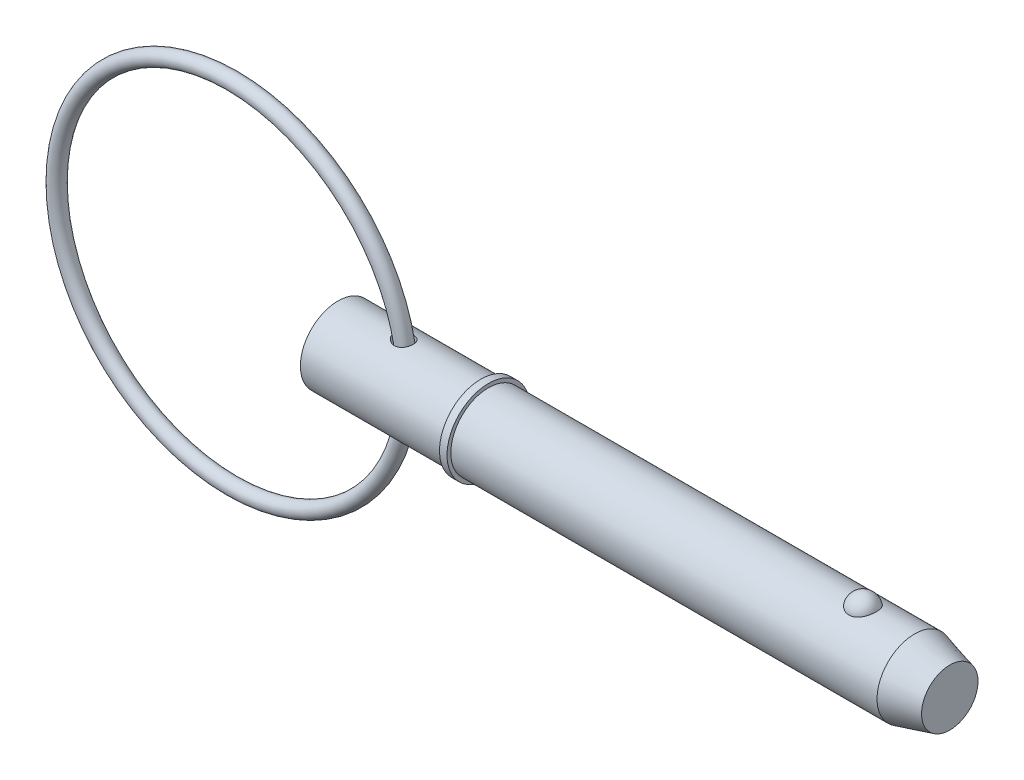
ISO-10303-21;
HEADER;
FILE_DESCRIPTION(('STEP AP214'),'2;1');
FILE_NAME('part.step','',(''),(''),'','','');
FILE_SCHEMA(('AUTOMOTIVE_DESIGN { 1 0 10303 214 1 1 1 1 }'));
ENDSEC;
DATA;
#1=APPLICATION_CONTEXT('core data for automotive mechanical design processes');
#2=APPLICATION_PROTOCOL_DEFINITION('international standard','automotive_design',2000,#1);
#3=PRODUCT_CONTEXT('',#1,'mechanical');
#4=PRODUCT('Part','Part','',(#3));
#5=PRODUCT_RELATED_PRODUCT_CATEGORY('part','',(#4));
#6=PRODUCT_DEFINITION_FORMATION('','',#4);
#7=PRODUCT_DEFINITION_CONTEXT('part definition',#1,'design');
#8=PRODUCT_DEFINITION('design','',#6,#7);
#9=PRODUCT_DEFINITION_SHAPE('','',#8);
#10=(LENGTH_UNIT() NAMED_UNIT(*) SI_UNIT(.MILLI.,.METRE.));
#11=(NAMED_UNIT(*) PLANE_ANGLE_UNIT() SI_UNIT($,.RADIAN.));
#12=(NAMED_UNIT(*) SI_UNIT($,.STERADIAN.) SOLID_ANGLE_UNIT());
#13=UNCERTAINTY_MEASURE_WITH_UNIT(LENGTH_MEASURE(1.E-05),#10,'distance_accuracy_value','');
#14=(GEOMETRIC_REPRESENTATION_CONTEXT(3) GLOBAL_UNCERTAINTY_ASSIGNED_CONTEXT((#13)) GLOBAL_UNIT_ASSIGNED_CONTEXT((#10,
#11,#12)) REPRESENTATION_CONTEXT('',''));
#15=CARTESIAN_POINT('',(0.,0.,0.));
#16=DIRECTION('',(0.,0.,1.));
#17=DIRECTION('',(1.,0.,0.));
#18=AXIS2_PLACEMENT_3D('',#15,#16,#17);
#19=CARTESIAN_POINT('',(-13.4013067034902,0.,0.));
#20=DIRECTION('',(0.,0.,1.));
#21=DIRECTION('',(1.,0.,0.));
#22=AXIS2_PLACEMENT_3D('',#19,#20,#21);
#23=TOROIDAL_SURFACE('',#22,22.225,0.952999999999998);
#24=CARTESIAN_POINT('',(9.77669329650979,0.,0.));
#25=VERTEX_POINT('',#24);
#26=VERTEX_LOOP('',#25);
#27=FACE_BOUND('',#26,.T.);
#28=ADVANCED_FACE('P0_F12',(#27),#23,.T.);
#29=CLOSED_SHELL('',(#28));
#30=MANIFOLD_SOLID_BREP('P0_B1',#29);
#31=CARTESIAN_POINT('',(0.,0.,0.));
#32=DIRECTION('',(1.,0.,0.));
#33=DIRECTION('',(0.,0.,-1.));
#34=AXIS2_PLACEMENT_3D('',#31,#32,#33);
#35=CYLINDRICAL_SURFACE('',#34,4.765);
#36=CARTESIAN_POINT('',(7.31773584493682,4.71580709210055,-0.682926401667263));
#37=CARTESIAN_POINT('',(7.3607471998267,4.70750812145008,-0.740230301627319));
#38=CARTESIAN_POINT('',(7.40883112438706,4.69869300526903,-0.79371122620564));
#39=CARTESIAN_POINT('',(7.51340999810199,4.68106981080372,-0.89180043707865));
#40=CARTESIAN_POINT('',(7.56991882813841,4.67226176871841,-0.936393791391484));
#41=CARTESIAN_POINT('',(7.689548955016,4.65568581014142,-1.01560363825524));
#42=CARTESIAN_POINT('',(7.75265928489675,4.64791621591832,-1.05023633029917));
#43=CARTESIAN_POINT('',(7.88387110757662,4.6343185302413,-1.10870278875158));
#44=CARTESIAN_POINT('',(7.95197058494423,4.62848966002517,-1.13254088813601));
#45=CARTESIAN_POINT('',(8.09209413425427,4.6194749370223,-1.16877415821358));
#46=CARTESIAN_POINT('',(8.16415141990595,4.6163169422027,-1.18104886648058));
#47=CARTESIAN_POINT('',(8.30937958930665,4.61324608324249,-1.19299123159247));
#48=CARTESIAN_POINT('',(8.38255011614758,4.61333220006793,-1.19266284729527));
#49=CARTESIAN_POINT('',(8.52374186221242,4.61674026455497,-1.17939593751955));
#50=CARTESIAN_POINT('',(8.59183022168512,4.61989017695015,-1.16712781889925));
#51=CARTESIAN_POINT('',(8.72470143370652,4.62884731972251,-1.13107903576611));
#52=CARTESIAN_POINT('',(8.78948513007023,4.63465386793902,-1.10730132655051));
#53=CARTESIAN_POINT('',(8.91088768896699,4.64792402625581,-1.05016249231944));
#54=CARTESIAN_POINT('',(8.96774302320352,4.65530108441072,-1.01728198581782));
#55=CARTESIAN_POINT('',(9.07499804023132,4.67102002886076,-0.942471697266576));
#56=CARTESIAN_POINT('',(9.12539777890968,4.6793619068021,-0.900541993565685));
#57=CARTESIAN_POINT('',(9.21836221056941,4.69607497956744,-0.808868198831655));
#58=CARTESIAN_POINT('',(9.26093651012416,4.70444612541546,-0.759133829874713));
#59=CARTESIAN_POINT('',(9.33728390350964,4.72032100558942,-0.653192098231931));
#60=CARTESIAN_POINT('',(9.3710564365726,4.72782468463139,-0.596984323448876));
#61=CARTESIAN_POINT('',(9.42940600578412,4.74126034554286,-0.478808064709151));
#62=CARTESIAN_POINT('',(9.45384681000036,4.74716869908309,-0.416769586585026));
#63=CARTESIAN_POINT('',(9.49226260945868,4.75663465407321,-0.289362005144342));
#64=CARTESIAN_POINT('',(9.50623742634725,4.76019221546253,-0.22399284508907));
#65=CARTESIAN_POINT('',(9.52342004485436,4.76458450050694,-0.0914886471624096));
#66=CARTESIAN_POINT('',(9.52658321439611,4.7654079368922,-0.0243474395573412));
#67=CARTESIAN_POINT('',(9.52194012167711,4.76421136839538,0.109528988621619));
#68=CARTESIAN_POINT('',(9.51413380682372,4.7621913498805,0.176264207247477));
#69=CARTESIAN_POINT('',(9.48775485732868,4.75552896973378,0.307367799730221));
#70=CARTESIAN_POINT('',(9.4691926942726,4.75088915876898,0.371738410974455));
#71=CARTESIAN_POINT('',(9.42175836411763,4.73949008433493,0.496364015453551));
#72=CARTESIAN_POINT('',(9.39288586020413,4.73273075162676,0.556618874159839));
#73=CARTESIAN_POINT('',(9.32549385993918,4.71782154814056,0.671371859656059));
#74=CARTESIAN_POINT('',(9.28696367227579,4.70967013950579,0.725863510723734));
#75=CARTESIAN_POINT('',(9.20123305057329,4.6928883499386,0.827453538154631));
#76=CARTESIAN_POINT('',(9.15403300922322,4.68425799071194,0.874552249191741));
#77=CARTESIAN_POINT('',(9.05250467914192,4.66754854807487,0.959736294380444));
#78=CARTESIAN_POINT('',(8.99822095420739,4.65946646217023,0.997874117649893));
#79=CARTESIAN_POINT('',(8.88381123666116,4.64472049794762,1.06440739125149));
#80=CARTESIAN_POINT('',(8.82368614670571,4.63805640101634,1.09280434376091));
#81=CARTESIAN_POINT('',(8.70022952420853,4.62698068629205,1.13878427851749));
#82=CARTESIAN_POINT('',(8.63695594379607,4.62253830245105,1.15651569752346));
#83=CARTESIAN_POINT('',(8.50825296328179,4.61622454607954,1.18146656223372));
#84=CARTESIAN_POINT('',(8.44282353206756,4.61435321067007,1.18868585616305));
#85=CARTESIAN_POINT('',(8.31119087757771,4.61332122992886,1.19268442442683));
#86=CARTESIAN_POINT('',(8.24498542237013,4.61417920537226,1.18939198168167));
#87=CARTESIAN_POINT('',(8.11397487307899,4.61847671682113,1.17259121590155));
#88=CARTESIAN_POINT('',(8.04917011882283,4.62191687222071,1.15908044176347));
#89=CARTESIAN_POINT('',(7.91946226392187,4.63117528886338,1.12153047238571));
#90=CARTESIAN_POINT('',(7.85470460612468,4.6371000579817,1.09701575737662));
#91=CARTESIAN_POINT('',(7.7300035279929,4.65063246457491,1.03814807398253));
#92=CARTESIAN_POINT('',(7.67006197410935,4.65824075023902,1.00379131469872));
#93=CARTESIAN_POINT('',(7.55352765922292,4.67473656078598,0.924015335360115));
#94=CARTESIAN_POINT('',(7.49726947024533,4.68366994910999,0.878115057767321));
#95=CARTESIAN_POINT('',(7.39344083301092,4.70144936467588,0.777311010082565));
#96=CARTESIAN_POINT('',(7.34587087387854,4.71029538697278,0.722406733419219));
#97=CARTESIAN_POINT('',(7.26188955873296,4.72669773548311,0.605773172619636));
#98=CARTESIAN_POINT('',(7.22531316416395,4.73427229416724,0.544165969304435));
#99=CARTESIAN_POINT('',(7.16406269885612,4.74732663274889,0.415095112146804));
#100=CARTESIAN_POINT('',(7.13937848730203,4.75280819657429,0.347636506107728));
#101=CARTESIAN_POINT('',(7.10494917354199,4.7605495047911,0.215359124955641));
#102=CARTESIAN_POINT('',(7.09405441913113,4.76305589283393,0.150853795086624));
#103=CARTESIAN_POINT('',(7.08387189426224,4.76539656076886,0.0208839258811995));
#104=CARTESIAN_POINT('',(7.0845805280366,4.76523166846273,-0.0445803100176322));
#105=CARTESIAN_POINT('',(7.09709111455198,4.76236014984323,-0.169693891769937));
#106=CARTESIAN_POINT('',(7.10810913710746,4.75983315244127,-0.229428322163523));
#107=CARTESIAN_POINT('',(7.13959099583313,4.75276726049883,-0.346187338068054));
#108=CARTESIAN_POINT('',(7.16004881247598,4.7482296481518,-0.403213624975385));
#109=CARTESIAN_POINT('',(7.20270325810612,4.73907067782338,-0.498040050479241));
#110=CARTESIAN_POINT('',(7.22286864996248,4.73481668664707,-0.536809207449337));
#111=CARTESIAN_POINT('',(7.26730952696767,4.72570777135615,-0.611832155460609));
#112=CARTESIAN_POINT('',(7.29158512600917,4.72085283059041,-0.64808587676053));
#113=CARTESIAN_POINT('',(7.31773584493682,4.71580709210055,-0.682926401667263));
#114=B_SPLINE_CURVE_WITH_KNOTS('',3,(#36,#37,#38,#39,#40,#41,#42,#43,#44,#45,#46,#47,#48,#49,
#50,#51,#52,#53,#54,#55,#56,#57,#58,#59,#60,#61,#62,#63,#64,#65,#66,#67,#68,#69,#70,#71,#72,#73,
#74,#75,#76,#77,#78,#79,#80,#81,#82,#83,#84,#85,#86,#87,#88,#89,#90,#91,#92,#93,#94,#95,#96,#97,
#98,#99,#100,#101,#102,#103,#104,#105,#106,#107,#108,#109,#110,#111,#112,#113),.UNSPECIFIED.,
.T.,.F.,(4,2,2,2,2,2,2,2,2,2,2,2,2,2,2,2,2,2,2,2,2,2,2,2,2,2,2,2,2,2,2,2,2,2,2,2,2,2,4),(0.,
0.216219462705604,0.432799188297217,0.649024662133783,0.865163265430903,1.08352938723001,
1.30182691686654,1.50853487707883,1.71518978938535,1.91252381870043,2.1098561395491,
2.30694457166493,2.50404555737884,2.70392296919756,2.90380378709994,3.10450875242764,
3.30521468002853,3.5057255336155,3.70624293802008,3.90698330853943,4.10771458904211,
4.30723900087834,4.50673262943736,4.70338139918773,4.90003300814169,5.09802914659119,
5.29607279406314,5.5036500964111,5.7113074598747,5.92972727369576,6.14815938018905,
6.36312650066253,6.57790998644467,6.77325899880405,6.96854747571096,7.15009726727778,
7.33153144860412,7.46298830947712,7.59444881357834),.UNSPECIFIED.);
#115=CARTESIAN_POINT('',(7.31773584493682,4.71580709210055,-0.682926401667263));
#116=VERTEX_POINT('',#115);
#117=EDGE_CURVE('P1_E42',#116,#116,#114,.T.);
#118=ORIENTED_EDGE('',*,*,#117,.T.);
#119=EDGE_LOOP('',(#118));
#120=FACE_BOUND('',#119,.T.);
#121=CARTESIAN_POINT('',(0.,0.,0.));
#122=DIRECTION('',(1.,0.,0.));
#123=DIRECTION('',(0.,0.,-1.));
#124=AXIS2_PLACEMENT_3D('',#121,#122,#123);
#125=CIRCLE('',#124,4.765);
#126=CARTESIAN_POINT('',(0.,0.,-4.765));
#127=VERTEX_POINT('',#126);
#128=EDGE_CURVE('P1_E9',#127,#127,#125,.T.);
#129=ORIENTED_EDGE('',*,*,#128,.T.);
#130=EDGE_LOOP('',(#129));
#131=FACE_BOUND('',#130,.T.);
#132=CARTESIAN_POINT('',(18.097,0.,0.));
#133=DIRECTION('',(1.,0.,0.));
#134=DIRECTION('',(0.,0.,-1.));
#135=AXIS2_PLACEMENT_3D('',#132,#133,#134);
#136=CIRCLE('',#135,4.765);
#137=CARTESIAN_POINT('',(18.097,0.,-4.765));
#138=VERTEX_POINT('',#137);
#139=EDGE_CURVE('P1_E25',#138,#138,#136,.T.);
#140=ORIENTED_EDGE('',*,*,#139,.F.);
#141=EDGE_LOOP('',(#140));
#142=FACE_BOUND('',#141,.T.);
#143=CARTESIAN_POINT('',(7.31773584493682,-4.71580709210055,-0.682926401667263));
#144=CARTESIAN_POINT('',(7.27956054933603,-4.72317282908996,-0.63206220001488));
#145=CARTESIAN_POINT('',(7.24535712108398,-4.7301361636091,-0.578155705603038));
#146=CARTESIAN_POINT('',(7.18611785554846,-4.74256090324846,-0.465352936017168));
#147=CARTESIAN_POINT('',(7.16107836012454,-4.74802290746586,-0.406458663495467));
#148=CARTESIAN_POINT('',(7.12119149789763,-4.75686558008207,-0.284913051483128));
#149=CARTESIAN_POINT('',(7.1063796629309,-4.76023898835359,-0.222249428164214));
#150=CARTESIAN_POINT('',(7.08786546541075,-4.76447177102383,-0.0952170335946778));
#151=CARTESIAN_POINT('',(7.08416018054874,-4.76533180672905,-0.0308487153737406));
#152=CARTESIAN_POINT('',(7.08795686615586,-4.76445764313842,0.0942755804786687));
#153=CARTESIAN_POINT('',(7.09490366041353,-4.762851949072,0.155050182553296));
#154=CARTESIAN_POINT('',(7.11863973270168,-4.75746086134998,0.2745356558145));
#155=CARTESIAN_POINT('',(7.13542953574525,-4.75367535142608,0.333246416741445));
#156=CARTESIAN_POINT('',(7.17817193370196,-4.74430545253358,0.447305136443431));
#157=CARTESIAN_POINT('',(7.20415836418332,-4.73871442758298,0.502639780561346));
#158=CARTESIAN_POINT('',(7.26428068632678,-4.72628508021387,0.608523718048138));
#159=CARTESIAN_POINT('',(7.29841897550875,-4.71944639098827,0.659071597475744));
#160=CARTESIAN_POINT('',(7.37680984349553,-4.70456239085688,0.758311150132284));
#161=CARTESIAN_POINT('',(7.42165519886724,-4.69646426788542,0.806526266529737));
#162=CARTESIAN_POINT('',(7.51828933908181,-4.68032890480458,0.895428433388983));
#163=CARTESIAN_POINT('',(7.57008134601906,-4.67229169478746,0.936111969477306));
#164=CARTESIAN_POINT('',(7.68397204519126,-4.65640659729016,1.01229731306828));
#165=CARTESIAN_POINT('',(7.74657226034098,-4.64863251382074,1.04706751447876));
#166=CARTESIAN_POINT('',(7.87680110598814,-4.6349740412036,1.10596507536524));
#167=CARTESIAN_POINT('',(7.94443054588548,-4.62908995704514,1.13009071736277));
#168=CARTESIAN_POINT('',(8.08402017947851,-4.61989019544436,1.16713943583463));
#169=CARTESIAN_POINT('',(8.15603143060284,-4.61661596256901,1.17988211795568));
#170=CARTESIAN_POINT('',(8.30124697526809,-4.61330446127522,1.1927680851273));
#171=CARTESIAN_POINT('',(8.37445077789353,-4.61326589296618,1.19291642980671));
#172=CARTESIAN_POINT('',(8.51584800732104,-4.61644036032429,1.18056687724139));
#173=CARTESIAN_POINT('',(8.58410302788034,-4.61948317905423,1.16873099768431));
#174=CARTESIAN_POINT('',(8.71738052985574,-4.6282520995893,1.13350536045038));
#175=CARTESIAN_POINT('',(8.78240382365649,-4.63397752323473,1.11011852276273));
#176=CARTESIAN_POINT('',(8.90428519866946,-4.64711877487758,1.05371003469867));
#177=CARTESIAN_POINT('',(8.96138096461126,-4.6544450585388,1.02117932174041));
#178=CARTESIAN_POINT('',(9.06916653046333,-4.6700970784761,0.947021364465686));
#179=CARTESIAN_POINT('',(9.11985639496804,-4.67842280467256,0.905394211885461));
#180=CARTESIAN_POINT('',(9.2134071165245,-4.69513303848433,0.814300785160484));
#181=CARTESIAN_POINT('',(9.25628268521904,-4.70351740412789,0.764849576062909));
#182=CARTESIAN_POINT('',(9.33327173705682,-4.71945185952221,0.659422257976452));
#183=CARTESIAN_POINT('',(9.3673846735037,-4.72700189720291,0.603445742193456));
#184=CARTESIAN_POINT('',(9.42645214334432,-4.74055953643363,0.485673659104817));
#185=CARTESIAN_POINT('',(9.45127042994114,-4.74654383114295,0.423807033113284));
#186=CARTESIAN_POINT('',(9.49046298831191,-4.756182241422,0.296676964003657));
#187=CARTESIAN_POINT('',(9.50483706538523,-4.75983631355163,0.231413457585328));
#188=CARTESIAN_POINT('',(9.52283408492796,-4.76443282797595,0.0990368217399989));
#189=CARTESIAN_POINT('',(9.52641016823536,-4.76536345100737,0.0319169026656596));
#190=CARTESIAN_POINT('',(9.52259067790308,-4.76437893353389,-0.101988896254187));
#191=CARTESIAN_POINT('',(9.5151950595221,-4.76246378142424,-0.168774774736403));
#192=CARTESIAN_POINT('',(9.48962516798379,-4.75599746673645,-0.300048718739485));
#193=CARTESIAN_POINT('',(9.4714615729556,-4.75144891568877,-0.364538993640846));
#194=CARTESIAN_POINT('',(9.42480303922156,-4.74020887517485,-0.489470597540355));
#195=CARTESIAN_POINT('',(9.396307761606,-4.73351731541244,-0.549911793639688));
#196=CARTESIAN_POINT('',(9.32963953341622,-4.71871240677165,-0.665099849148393));
#197=CARTESIAN_POINT('',(9.29145577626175,-4.71059747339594,-0.719840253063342));
#198=CARTESIAN_POINT('',(9.20637695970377,-4.69385254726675,-0.82198328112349));
#199=CARTESIAN_POINT('',(9.15948227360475,-4.68522257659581,-0.869386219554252));
#200=CARTESIAN_POINT('',(9.05849937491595,-4.66847516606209,-0.955233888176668));
#201=CARTESIAN_POINT('',(9.00445430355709,-4.6603550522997,-0.993728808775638));
#202=CARTESIAN_POINT('',(8.8904576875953,-4.64550122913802,-1.06100691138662));
#203=CARTESIAN_POINT('',(8.83050704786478,-4.63876730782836,-1.08979157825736));
#204=CARTESIAN_POINT('',(8.70732873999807,-4.6275305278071,-1.13655620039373));
#205=CARTESIAN_POINT('',(8.64416019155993,-4.62299714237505,-1.15468477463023));
#206=CARTESIAN_POINT('',(8.51559711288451,-4.61649071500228,-1.18043067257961));
#207=CARTESIAN_POINT('',(8.4502025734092,-4.61451768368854,-1.18804795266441));
#208=CARTESIAN_POINT('',(8.31862013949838,-4.61328355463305,-1.19283094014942));
#209=CARTESIAN_POINT('',(8.25242983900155,-4.61403911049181,-1.18993246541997));
#210=CARTESIAN_POINT('',(8.12138461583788,-4.61814057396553,-1.17391149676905));
#211=CARTESIAN_POINT('',(8.0565300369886,-4.62148714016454,-1.16078640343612));
#212=CARTESIAN_POINT('',(7.92669960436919,-4.63056912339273,-1.12402333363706));
#213=CARTESIAN_POINT('',(7.86186447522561,-4.63641051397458,-1.09991536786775));
#214=CARTESIAN_POINT('',(7.73694230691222,-4.64980121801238,-1.04185298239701));
#215=CARTESIAN_POINT('',(7.6768568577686,-4.65735110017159,-1.0078952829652));
#216=CARTESIAN_POINT('',(7.56207884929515,-4.67346080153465,-0.930364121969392));
#217=CARTESIAN_POINT('',(7.5074784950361,-4.68203382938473,-0.886656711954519));
#218=CARTESIAN_POINT('',(7.40624045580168,-4.69916824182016,-0.79082583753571));
#219=CARTESIAN_POINT('',(7.35959988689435,-4.7077296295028,-0.738705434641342));
#220=CARTESIAN_POINT('',(7.31773584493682,-4.71580709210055,-0.682926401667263));
#221=B_SPLINE_CURVE_WITH_KNOTS('',3,(#143,#144,#145,#146,#147,#148,#149,#150,#151,#152,#153,
#154,#155,#156,#157,#158,#159,#160,#161,#162,#163,#164,#165,#166,#167,#168,#169,#170,#171,#172,
#173,#174,#175,#176,#177,#178,#179,#180,#181,#182,#183,#184,#185,#186,#187,#188,#189,#190,#191,
#192,#193,#194,#195,#196,#197,#198,#199,#200,#201,#202,#203,#204,#205,#206,#207,#208,#209,#210,
#211,#212,#213,#214,#215,#216,#217,#218,#219,#220),.UNSPECIFIED.,.T.,.F.,(4,2,2,2,2,2,2,2,2,2,2,
2,2,2,2,2,2,2,2,2,2,2,2,2,2,2,2,2,2,2,2,2,2,2,2,2,2,2,4),(0.,0.191851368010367,0.38362606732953,
0.576063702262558,0.768450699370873,0.951145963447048,1.13385097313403,1.31723528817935,
1.50067360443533,1.69887079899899,1.8971602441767,2.11225870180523,2.32739185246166,
2.54587681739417,2.76427400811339,2.97123130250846,3.17813630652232,3.37555441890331,
3.57297054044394,3.77001106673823,3.96706388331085,4.16690159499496,4.36674303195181,
4.56745046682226,4.76815872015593,4.96866827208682,5.16918440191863,5.36992517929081,
5.5706573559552,5.77022940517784,5.96977092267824,6.16645904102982,6.36314797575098,
6.56103940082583,6.75898114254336,6.96633026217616,7.17374850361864,7.384214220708,
7.59460352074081),.UNSPECIFIED.);
#222=CARTESIAN_POINT('',(7.31773584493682,-4.71580709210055,-0.682926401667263));
#223=VERTEX_POINT('',#222);
#224=EDGE_CURVE('P1_E17',#223,#223,#221,.T.);
#225=ORIENTED_EDGE('',*,*,#224,.T.);
#226=EDGE_LOOP('',(#225));
#227=FACE_BOUND('',#226,.T.);
#228=ADVANCED_FACE('P1_F13',(#120,#131,#142,#227),#35,.T.);
#229=CARTESIAN_POINT('',(0.,0.,0.));
#230=DIRECTION('',(1.,0.,0.));
#231=DIRECTION('',(0.,0.,-1.));
#232=AXIS2_PLACEMENT_3D('',#229,#230,#231);
#233=CYLINDRICAL_SURFACE('',#232,4.765);
#234=CARTESIAN_POINT('',(73.0241944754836,0.,0.));
#235=DIRECTION('',(1.,0.,0.));
#236=DIRECTION('',(0.,0.,-1.));
#237=AXIS2_PLACEMENT_3D('',#234,#235,#236);
#238=CIRCLE('',#237,4.765);
#239=CARTESIAN_POINT('',(73.0241944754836,0.,-4.765));
#240=VERTEX_POINT('',#239);
#241=EDGE_CURVE('P1_E99',#240,#240,#238,.T.);
#242=ORIENTED_EDGE('',*,*,#241,.F.);
#243=EDGE_LOOP('',(#242));
#244=FACE_BOUND('',#243,.T.);
#245=CARTESIAN_POINT('',(19.05,0.,0.));
#246=DIRECTION('',(1.,0.,0.));
#247=DIRECTION('',(0.,0.,-1.));
#248=AXIS2_PLACEMENT_3D('',#245,#246,#247);
#249=CIRCLE('',#248,4.765);
#250=CARTESIAN_POINT('',(19.05,0.,-4.765));
#251=VERTEX_POINT('',#250);
#252=EDGE_CURVE('P1_E96',#251,#251,#249,.T.);
#253=ORIENTED_EDGE('',*,*,#252,.T.);
#254=EDGE_LOOP('',(#253));
#255=FACE_BOUND('',#254,.T.);
#256=CARTESIAN_POINT('',(66.471020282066,4.42764777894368,1.76101111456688));
#257=CARTESIAN_POINT('',(66.3797212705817,4.42764470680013,1.76101422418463));
#258=CARTESIAN_POINT('',(66.2884468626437,4.43059091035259,1.75366340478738));
#259=CARTESIAN_POINT('',(66.108615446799,4.44201846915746,1.72451180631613));
#260=CARTESIAN_POINT('',(66.0200577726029,4.45049845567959,1.70271460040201));
#261=CARTESIAN_POINT('',(65.8482570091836,4.47200516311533,1.6453937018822));
#262=CARTESIAN_POINT('',(65.7650064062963,4.48502527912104,1.60988994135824));
#263=CARTESIAN_POINT('',(65.6057633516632,4.51419542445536,1.52617873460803));
#264=CARTESIAN_POINT('',(65.5297723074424,4.53034605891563,1.47796883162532));
#265=CARTESIAN_POINT('',(65.3847445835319,4.5645931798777,1.36860494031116));
#266=CARTESIAN_POINT('',(65.3159645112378,4.58273170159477,1.30712420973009));
#267=CARTESIAN_POINT('',(65.1893423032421,4.61870302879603,1.1737020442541));
#268=CARTESIAN_POINT('',(65.1315021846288,4.63653577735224,1.1017586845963));
#269=CARTESIAN_POINT('',(65.0255709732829,4.67090140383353,0.945806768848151));
#270=CARTESIAN_POINT('',(64.9780305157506,4.68734068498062,0.861402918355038));
#271=CARTESIAN_POINT('',(64.8970817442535,4.71628466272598,0.685442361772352));
#272=CARTESIAN_POINT('',(64.8636747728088,4.72878898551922,0.59388497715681));
#273=CARTESIAN_POINT('',(64.811287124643,4.74874061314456,0.404781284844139));
#274=CARTESIAN_POINT('',(64.7925178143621,4.75611366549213,0.30716844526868));
#275=CARTESIAN_POINT('',(64.7705846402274,4.76475393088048,0.109940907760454));
#276=CARTESIAN_POINT('',(64.7674205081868,4.76602124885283,0.0103262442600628));
#277=CARTESIAN_POINT('',(64.7767405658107,4.76232928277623,-0.187629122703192));
#278=CARTESIAN_POINT('',(64.7891588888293,4.7573962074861,-0.285973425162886));
#279=CARTESIAN_POINT('',(64.8292804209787,4.74184975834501,-0.47902728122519));
#280=CARTESIAN_POINT('',(64.8569839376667,4.7312362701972,-0.573736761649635));
#281=CARTESIAN_POINT('',(64.9271581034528,4.70540026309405,-0.756973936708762));
#282=CARTESIAN_POINT('',(64.9696460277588,4.69017235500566,-0.845494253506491));
#283=CARTESIAN_POINT('',(65.068520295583,4.6566986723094,-1.01378033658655));
#284=CARTESIAN_POINT('',(65.1249076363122,4.63845268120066,-1.09354547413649));
#285=CARTESIAN_POINT('',(65.250552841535,4.60085438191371,-1.24228523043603));
#286=CARTESIAN_POINT('',(65.3198439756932,4.58149930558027,-1.31123108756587));
#287=CARTESIAN_POINT('',(65.4696066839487,4.54391653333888,-1.43607409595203));
#288=CARTESIAN_POINT('',(65.5500771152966,4.52568872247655,-1.49197257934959));
#289=CARTESIAN_POINT('',(65.7181500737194,4.49293007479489,-1.58786764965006));
#290=CARTESIAN_POINT('',(65.8055445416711,4.47832346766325,-1.62820219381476));
#291=CARTESIAN_POINT('',(65.9865534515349,4.45406011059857,-1.69345757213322));
#292=CARTESIAN_POINT('',(66.0801655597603,4.44440151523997,-1.71838415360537));
#293=CARTESIAN_POINT('',(66.2658939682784,4.43159888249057,-1.75112843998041));
#294=CARTESIAN_POINT('',(66.357849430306,4.42815213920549,-1.75974223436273));
#295=CARTESIAN_POINT('',(66.5419658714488,4.427247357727,-1.76201865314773));
#296=CARTESIAN_POINT('',(66.6341268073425,4.42978816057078,-1.7556841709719));
#297=CARTESIAN_POINT('',(66.8131292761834,4.4403864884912,-1.72869560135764));
#298=CARTESIAN_POINT('',(66.9000474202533,4.44827555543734,-1.70847853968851));
#299=CARTESIAN_POINT('',(67.0691314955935,4.46852246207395,-1.65479562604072));
#300=CARTESIAN_POINT('',(67.1512970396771,4.48088066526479,-1.62132869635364));
#301=CARTESIAN_POINT('',(67.3105916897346,4.50907357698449,-1.54120560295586));
#302=CARTESIAN_POINT('',(67.3875700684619,4.52497884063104,-1.49427526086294));
#303=CARTESIAN_POINT('',(67.5327080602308,4.55845148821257,-1.38881222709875));
#304=CARTESIAN_POINT('',(67.6008656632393,4.57601924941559,-1.33027689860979));
#305=CARTESIAN_POINT('',(67.7300990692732,4.61196537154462,-1.19991049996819));
#306=CARTESIAN_POINT('',(67.7906562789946,4.63034074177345,-1.12756415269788));
#307=CARTESIAN_POINT('',(67.8992797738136,4.66513959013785,-0.973612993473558));
#308=CARTESIAN_POINT('',(67.9473438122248,4.68156271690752,-0.892006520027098));
#309=CARTESIAN_POINT('',(68.031383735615,4.71130224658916,-0.718892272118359));
#310=CARTESIAN_POINT('',(68.0669185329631,4.724501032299,-0.627149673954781));
#311=CARTESIAN_POINT('',(68.1229522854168,4.74571823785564,-0.438611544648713));
#312=CARTESIAN_POINT('',(68.143450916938,4.75373654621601,-0.341815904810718));
#313=CARTESIAN_POINT('',(68.1690338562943,4.76378905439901,-0.145633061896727));
#314=CARTESIAN_POINT('',(68.174076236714,4.76580697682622,-0.0462395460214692));
#315=CARTESIAN_POINT('',(68.1685239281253,4.7636057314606,0.152038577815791));
#316=CARTESIAN_POINT('',(68.1579294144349,4.75938663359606,0.250923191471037));
#317=CARTESIAN_POINT('',(68.1213875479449,4.74516937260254,0.445004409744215));
#318=CARTESIAN_POINT('',(68.0954964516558,4.73519238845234,0.54021317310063));
#319=CARTESIAN_POINT('',(68.0289273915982,4.71049394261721,0.724662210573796));
#320=CARTESIAN_POINT('',(67.988248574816,4.69577220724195,0.81390214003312));
#321=CARTESIAN_POINT('',(67.8927177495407,4.66303767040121,0.984313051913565));
#322=CARTESIAN_POINT('',(67.8378042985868,4.64501070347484,1.06544688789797));
#323=CARTESIAN_POINT('',(67.7150496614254,4.60764678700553,1.21692673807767));
#324=CARTESIAN_POINT('',(67.6472086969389,4.58830985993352,1.2872729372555));
#325=CARTESIAN_POINT('',(67.5005480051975,4.55060370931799,1.41479271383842));
#326=CARTESIAN_POINT('',(67.4217918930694,4.53222967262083,1.47203785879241));
#327=CARTESIAN_POINT('',(67.2549890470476,4.49849576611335,1.57212016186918));
#328=CARTESIAN_POINT('',(67.1669417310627,4.48313608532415,1.61495641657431));
#329=CARTESIAN_POINT('',(66.9797918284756,4.45676184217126,1.68642657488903));
#330=CARTESIAN_POINT('',(66.8803653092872,4.44598302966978,1.71430590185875));
#331=CARTESIAN_POINT('',(66.6776210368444,4.43142918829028,1.75159258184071));
#332=CARTESIAN_POINT('',(66.5743049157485,4.42765125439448,1.76100759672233));
#333=CARTESIAN_POINT('',(66.471020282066,4.42764777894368,1.76101111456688));
#334=B_SPLINE_CURVE_WITH_KNOTS('',3,(#256,#257,#258,#259,#260,#261,#262,#263,#264,#265,#266,
#267,#268,#269,#270,#271,#272,#273,#274,#275,#276,#277,#278,#279,#280,#281,#282,#283,#284,#285,
#286,#287,#288,#289,#290,#291,#292,#293,#294,#295,#296,#297,#298,#299,#300,#301,#302,#303,#304,
#305,#306,#307,#308,#309,#310,#311,#312,#313,#314,#315,#316,#317,#318,#319,#320,#321,#322,#323,
#324,#325,#326,#327,#328,#329,#330,#331,#332,#333),.UNSPECIFIED.,.T.,.F.,(4,2,2,2,2,2,2,2,2,2,2,
2,2,2,2,2,2,2,2,2,2,2,2,2,2,2,2,2,2,2,2,2,2,2,2,2,2,2,4),(0.,0.273517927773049,
0.546968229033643,0.820022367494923,1.09312934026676,1.37393946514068,1.65480131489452,
1.94820420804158,2.24163496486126,2.53922817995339,2.8368162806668,3.13315071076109,
3.42949110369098,3.72617893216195,4.02288805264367,4.32037303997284,4.61782764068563,
4.9084009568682,5.19886582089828,5.4747485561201,5.75057789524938,6.01809977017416,
6.2856434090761,6.55907787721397,6.83257454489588,7.11962987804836,7.40673679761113,
7.70312663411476,7.99952284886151,8.29672237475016,8.59391856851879,8.89002850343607,
9.18615552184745,9.483582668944,9.78100471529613,10.0767610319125,10.3725358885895,
10.6820893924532,10.991514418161),.UNSPECIFIED.);
#335=CARTESIAN_POINT('',(66.471020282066,4.42764777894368,1.76101111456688));
#336=VERTEX_POINT('',#335);
#337=EDGE_CURVE('P1_E34',#336,#336,#334,.T.);
#338=ORIENTED_EDGE('',*,*,#337,.T.);
#339=EDGE_LOOP('',(#338));
#340=FACE_BOUND('',#339,.T.);
#341=ADVANCED_FACE('P1_F46',(#244,#255,#340),#233,.T.);
#342=CARTESIAN_POINT('',(0.,0.,0.));
#343=DIRECTION('',(-1.,0.,0.));
#344=DIRECTION('',(0.,0.,1.));
#345=AXIS2_PLACEMENT_3D('',#342,#343,#344);
#346=PLANE('',#345);
#347=ORIENTED_EDGE('',*,*,#128,.F.);
#348=EDGE_LOOP('',(#347));
#349=FACE_BOUND('',#348,.T.);
#350=ADVANCED_FACE('P1_F15',(#349),#346,.T.);
#351=CARTESIAN_POINT('',(18.097,4.765,0.));
#352=DIRECTION('',(-1.,0.,0.));
#353=DIRECTION('',(0.,0.,1.));
#354=AXIS2_PLACEMENT_3D('',#351,#352,#353);
#355=PLANE('',#354);
#356=ORIENTED_EDGE('',*,*,#139,.T.);
#357=EDGE_LOOP('',(#356));
#358=FACE_BOUND('',#357,.T.);
#359=CARTESIAN_POINT('',(18.097,0.,0.));
#360=DIRECTION('',(1.,0.,0.));
#361=DIRECTION('',(0.,0.,-1.));
#362=AXIS2_PLACEMENT_3D('',#359,#360,#361);
#363=CIRCLE('',#362,5.2415);
#364=CARTESIAN_POINT('',(18.097,0.,-5.2415));
#365=VERTEX_POINT('',#364);
#366=EDGE_CURVE('P1_E30',#365,#365,#363,.T.);
#367=ORIENTED_EDGE('',*,*,#366,.F.);
#368=EDGE_LOOP('',(#367));
#369=FACE_BOUND('',#368,.T.);
#370=ADVANCED_FACE('P1_F81',(#358,#369),#355,.T.);
#371=CARTESIAN_POINT('',(0.,0.,0.));
#372=DIRECTION('',(1.,0.,0.));
#373=DIRECTION('',(0.,0.,-1.));
#374=AXIS2_PLACEMENT_3D('',#371,#372,#373);
#375=CYLINDRICAL_SURFACE('',#374,5.2415);
#376=ORIENTED_EDGE('',*,*,#366,.T.);
#377=EDGE_LOOP('',(#376));
#378=FACE_BOUND('',#377,.T.);
#379=CARTESIAN_POINT('',(19.05,0.,0.));
#380=DIRECTION('',(1.,0.,0.));
#381=DIRECTION('',(0.,0.,-1.));
#382=AXIS2_PLACEMENT_3D('',#379,#380,#381);
#383=CIRCLE('',#382,5.2415);
#384=CARTESIAN_POINT('',(19.05,0.,-5.2415));
#385=VERTEX_POINT('',#384);
#386=EDGE_CURVE('P1_E95',#385,#385,#383,.T.);
#387=ORIENTED_EDGE('',*,*,#386,.F.);
#388=EDGE_LOOP('',(#387));
#389=FACE_BOUND('',#388,.T.);
#390=ADVANCED_FACE('P1_F68',(#378,#389),#375,.T.);
#391=CARTESIAN_POINT('',(19.05,5.2415,0.));
#392=DIRECTION('',(1.,0.,0.));
#393=DIRECTION('',(0.,0.,-1.));
#394=AXIS2_PLACEMENT_3D('',#391,#392,#393);
#395=PLANE('',#394);
#396=ORIENTED_EDGE('',*,*,#386,.T.);
#397=EDGE_LOOP('',(#396));
#398=FACE_BOUND('',#397,.T.);
#399=ORIENTED_EDGE('',*,*,#252,.F.);
#400=EDGE_LOOP('',(#399));
#401=FACE_BOUND('',#400,.T.);
#402=ADVANCED_FACE('P1_F62',(#398,#401),#395,.T.);
#403=CARTESIAN_POINT('',(77.47,0.,0.));
#404=DIRECTION('',(-1.,0.,0.));
#405=DIRECTION('',(0.,0.,1.));
#406=AXIS2_PLACEMENT_3D('',#403,#404,#405);
#407=CONICAL_SURFACE('',#406,3.57375000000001,0.26179938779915);
#408=ORIENTED_EDGE('',*,*,#241,.T.);
#409=EDGE_LOOP('',(#408));
#410=FACE_BOUND('',#409,.T.);
#411=CARTESIAN_POINT('',(77.47,0.,0.));
#412=DIRECTION('',(1.,0.,0.));
#413=DIRECTION('',(0.,0.,-1.));
#414=AXIS2_PLACEMENT_3D('',#411,#412,#413);
#415=CIRCLE('',#414,3.57375000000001);
#416=CARTESIAN_POINT('',(77.47,0.,-3.57375000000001));
#417=VERTEX_POINT('',#416);
#418=EDGE_CURVE('P1_E41',#417,#417,#415,.T.);
#419=ORIENTED_EDGE('',*,*,#418,.F.);
#420=EDGE_LOOP('',(#419));
#421=FACE_BOUND('',#420,.T.);
#422=ADVANCED_FACE('P1_F59',(#410,#421),#407,.T.);
#423=CARTESIAN_POINT('',(77.47,3.57375000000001,0.));
#424=DIRECTION('',(1.,0.,0.));
#425=DIRECTION('',(0.,0.,-1.));
#426=AXIS2_PLACEMENT_3D('',#423,#424,#425);
#427=PLANE('',#426);
#428=ORIENTED_EDGE('',*,*,#418,.T.);
#429=EDGE_LOOP('',(#428));
#430=FACE_BOUND('',#429,.T.);
#431=ADVANCED_FACE('P1_F55',(#430),#427,.T.);
#432=CARTESIAN_POINT('',(66.471020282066,4.2885,0.));
#433=DIRECTION('',(-1.,0.,0.));
#434=DIRECTION('',(0.,1.,0.));
#435=AXIS2_PLACEMENT_3D('',#432,#433,#434);
#436=SPHERICAL_SURFACE('',#435,1.7665);
#437=ORIENTED_EDGE('',*,*,#337,.F.);
#438=EDGE_LOOP('',(#437));
#439=FACE_BOUND('',#438,.T.);
#440=ADVANCED_FACE('P1_F50',(#439),#436,.T.);
#441=CARTESIAN_POINT('',(-13.4013067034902,0.,0.));
#442=DIRECTION('',(0.,0.,1.));
#443=DIRECTION('',(1.,0.,0.));
#444=AXIS2_PLACEMENT_3D('',#441,#442,#443);
#445=TOROIDAL_SURFACE('',#444,22.225,1.19125);
#446=ORIENTED_EDGE('',*,*,#224,.F.);
#447=EDGE_LOOP('',(#446));
#448=FACE_BOUND('',#447,.T.);
#449=ORIENTED_EDGE('',*,*,#117,.F.);
#450=EDGE_LOOP('',(#449));
#451=FACE_BOUND('',#450,.T.);
#452=ADVANCED_FACE('P1_F54',(#448,#451),#445,.F.);
#453=CLOSED_SHELL('',(#228,#341,#350,#370,#390,#402,#422,#431,#440,#452));
#454=MANIFOLD_SOLID_BREP('P1_B1',#453);
#455=ADVANCED_BREP_SHAPE_REPRESENTATION('',(#18,#30,#454),#14);
#456=SHAPE_DEFINITION_REPRESENTATION(#9,#455);
ENDSEC;
END-ISO-10303-21;
